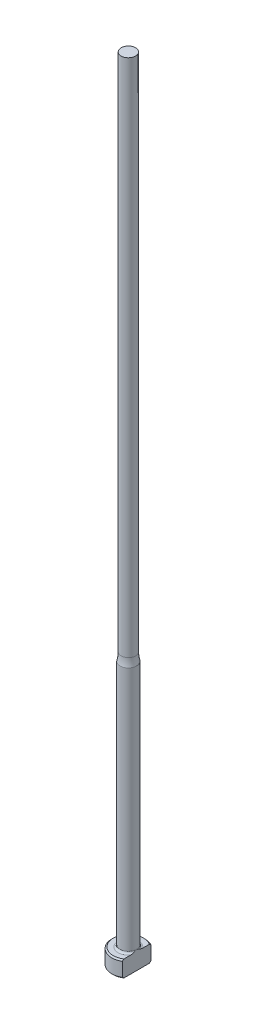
ISO-10303-21;
HEADER;
FILE_DESCRIPTION(('STEP AP214'),'2;1');
FILE_NAME('part.step','',(''),(''),'','','');
FILE_SCHEMA(('AUTOMOTIVE_DESIGN { 1 0 10303 214 1 1 1 1 }'));
ENDSEC;
DATA;
#1=APPLICATION_CONTEXT('core data for automotive mechanical design processes');
#2=APPLICATION_PROTOCOL_DEFINITION('international standard','automotive_design',2000,#1);
#3=PRODUCT_CONTEXT('',#1,'mechanical');
#4=PRODUCT('Part','Part','',(#3));
#5=PRODUCT_RELATED_PRODUCT_CATEGORY('part','',(#4));
#6=PRODUCT_DEFINITION_FORMATION('','',#4);
#7=PRODUCT_DEFINITION_CONTEXT('part definition',#1,'design');
#8=PRODUCT_DEFINITION('design','',#6,#7);
#9=PRODUCT_DEFINITION_SHAPE('','',#8);
#10=(LENGTH_UNIT() NAMED_UNIT(*) SI_UNIT(.MILLI.,.METRE.));
#11=(NAMED_UNIT(*) PLANE_ANGLE_UNIT() SI_UNIT($,.RADIAN.));
#12=(NAMED_UNIT(*) SI_UNIT($,.STERADIAN.) SOLID_ANGLE_UNIT());
#13=UNCERTAINTY_MEASURE_WITH_UNIT(LENGTH_MEASURE(1.E-05),#10,'distance_accuracy_value','');
#14=(GEOMETRIC_REPRESENTATION_CONTEXT(3) GLOBAL_UNCERTAINTY_ASSIGNED_CONTEXT((#13)) GLOBAL_UNIT_ASSIGNED_CONTEXT((#10,
#11,#12)) REPRESENTATION_CONTEXT('',''));
#15=CARTESIAN_POINT('',(0.,0.,0.));
#16=DIRECTION('',(0.,0.,1.));
#17=DIRECTION('',(1.,0.,0.));
#18=AXIS2_PLACEMENT_3D('',#15,#16,#17);
#19=CARTESIAN_POINT('',(-3.17499999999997,3.175,0.));
#20=DIRECTION('',(0.,1.,0.));
#21=DIRECTION('',(0.,0.,1.));
#22=AXIS2_PLACEMENT_3D('',#19,#20,#21);
#23=PLANE('',#22);
#24=CARTESIAN_POINT('',(0.,3.175,0.));
#25=DIRECTION('',(0.,1.,0.));
#26=DIRECTION('',(0.,0.,1.));
#27=AXIS2_PLACEMENT_3D('',#24,#25,#26);
#28=CIRCLE('',#27,2.92099999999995);
#29=CARTESIAN_POINT('',(1.58749999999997,3.175,-2.45195529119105));
#30=VERTEX_POINT('',#29);
#31=CARTESIAN_POINT('',(1.58749999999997,3.175,2.45195529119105));
#32=VERTEX_POINT('',#31);
#33=EDGE_CURVE('E105',#30,#32,#28,.T.);
#34=ORIENTED_EDGE('',*,*,#33,.T.);
#35=DIRECTION('',(0.,0.,1.));
#36=VECTOR('',#35,1.);
#37=CARTESIAN_POINT('',(1.58749999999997,3.17500000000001,2.74963065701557));
#38=LINE('',#37,#36);
#39=CARTESIAN_POINT('',(1.58749999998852,3.175,1.16397422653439));
#40=VERTEX_POINT('',#39);
#41=EDGE_CURVE('E126',#40,#32,#38,.T.);
#42=ORIENTED_EDGE('',*,*,#41,.F.);
#43=CARTESIAN_POINT('',(0.,3.175,0.));
#44=DIRECTION('',(0.,1.,0.));
#45=DIRECTION('',(0.,0.,1.));
#46=AXIS2_PLACEMENT_3D('',#43,#44,#45);
#47=CIRCLE('',#46,1.96849999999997);
#48=CARTESIAN_POINT('',(1.58749999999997,3.175,-1.16397422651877));
#49=VERTEX_POINT('',#48);
#50=EDGE_CURVE('E11',#40,#49,#47,.F.);
#51=ORIENTED_EDGE('',*,*,#50,.T.);
#52=EDGE_CURVE('E52',#30,#49,#38,.T.);
#53=ORIENTED_EDGE('',*,*,#52,.F.);
#54=EDGE_LOOP('',(#34,#42,#51,#53));
#55=FACE_BOUND('',#54,.T.);
#56=ADVANCED_FACE('F32',(#55),#23,.T.);
#57=CARTESIAN_POINT('',(0.,259.958771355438,0.));
#58=DIRECTION('',(0.,1.,0.));
#59=DIRECTION('',(0.,0.,1.));
#60=AXIS2_PLACEMENT_3D('',#57,#58,#59);
#61=CYLINDRICAL_SURFACE('',#60,3.17499999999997);
#62=CARTESIAN_POINT('',(0.,2.92100000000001,0.));
#63=DIRECTION('',(0.,1.,0.));
#64=DIRECTION('',(0.,0.,1.));
#65=AXIS2_PLACEMENT_3D('',#62,#63,#64);
#66=CIRCLE('',#65,3.17499999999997);
#67=CARTESIAN_POINT('',(1.58749999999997,2.92100000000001,2.74963065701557));
#68=VERTEX_POINT('',#67);
#69=CARTESIAN_POINT('',(1.58749999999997,2.92100000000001,-2.74963065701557));
#70=VERTEX_POINT('',#69);
#71=EDGE_CURVE('E98',#68,#70,#66,.F.);
#72=ORIENTED_EDGE('',*,*,#71,.T.);
#73=DIRECTION('',(0.,-1.,0.));
#74=VECTOR('',#73,1.);
#75=CARTESIAN_POINT('',(1.58749999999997,152.401,-2.74963065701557));
#76=LINE('',#75,#74);
#77=CARTESIAN_POINT('',(1.58749999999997,0.254000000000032,-2.74963065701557));
#78=VERTEX_POINT('',#77);
#79=EDGE_CURVE('E141',#70,#78,#76,.T.);
#80=ORIENTED_EDGE('',*,*,#79,.T.);
#81=CARTESIAN_POINT('',(0.,0.254000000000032,0.));
#82=DIRECTION('',(0.,-1.,0.));
#83=DIRECTION('',(0.,0.,-1.));
#84=AXIS2_PLACEMENT_3D('',#81,#82,#83);
#85=CIRCLE('',#84,3.17499999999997);
#86=CARTESIAN_POINT('',(1.58749999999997,0.254000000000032,2.74963065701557));
#87=VERTEX_POINT('',#86);
#88=EDGE_CURVE('E95',#78,#87,#85,.F.);
#89=ORIENTED_EDGE('',*,*,#88,.T.);
#90=DIRECTION('',(0.,-1.,0.));
#91=VECTOR('',#90,1.);
#92=CARTESIAN_POINT('',(1.58749999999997,152.401,2.74963065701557));
#93=LINE('',#92,#91);
#94=EDGE_CURVE('E88',#68,#87,#93,.T.);
#95=ORIENTED_EDGE('',*,*,#94,.F.);
#96=EDGE_LOOP('',(#72,#80,#89,#95));
#97=FACE_BOUND('',#96,.T.);
#98=ADVANCED_FACE('F191',(#97),#61,.T.);
#99=CARTESIAN_POINT('',(0.,0.,0.));
#100=DIRECTION('',(0.,-1.,0.));
#101=DIRECTION('',(0.,0.,-1.));
#102=AXIS2_PLACEMENT_3D('',#99,#100,#101);
#103=PLANE('',#102);
#104=CARTESIAN_POINT('',(0.,0.,0.));
#105=DIRECTION('',(0.,-1.,0.));
#106=DIRECTION('',(0.,0.,-1.));
#107=AXIS2_PLACEMENT_3D('',#104,#105,#106);
#108=CIRCLE('',#107,2.92099999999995);
#109=CARTESIAN_POINT('',(1.58749999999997,0.,2.45195529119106));
#110=VERTEX_POINT('',#109);
#111=CARTESIAN_POINT('',(1.58749999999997,0.,-2.45195529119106));
#112=VERTEX_POINT('',#111);
#113=EDGE_CURVE('E93',#110,#112,#108,.T.);
#114=ORIENTED_EDGE('',*,*,#113,.T.);
#115=DIRECTION('',(0.,0.,1.));
#116=VECTOR('',#115,1.);
#117=CARTESIAN_POINT('',(1.58749999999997,0.,2.74963065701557));
#118=LINE('',#117,#116);
#119=EDGE_CURVE('E78',#112,#110,#118,.T.);
#120=ORIENTED_EDGE('',*,*,#119,.T.);
#121=EDGE_LOOP('',(#114,#120));
#122=FACE_BOUND('',#121,.T.);
#123=ADVANCED_FACE('F97',(#122),#103,.T.);
#124=CARTESIAN_POINT('',(0.,3.17499999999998,0.));
#125=DIRECTION('',(0.,-1.,0.));
#126=DIRECTION('',(0.,0.,-1.));
#127=AXIS2_PLACEMENT_3D('',#124,#125,#126);
#128=CONICAL_SURFACE('',#127,2.92099999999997,0.7853981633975);
#129=ORIENTED_EDGE('',*,*,#71,.F.);
#130=CARTESIAN_POINT('',(1.58749999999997,-0.161620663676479,-6.0529050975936));
#131=CARTESIAN_POINT('',(1.58749999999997,-0.0288893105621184,-5.91567682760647));
#132=CARTESIAN_POINT('',(1.58749999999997,0.103699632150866,-5.77831035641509));
#133=CARTESIAN_POINT('',(1.58749999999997,0.36850839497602,-5.5032187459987));
#134=CARTESIAN_POINT('',(1.58749999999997,0.500728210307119,-5.36549360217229));
#135=CARTESIAN_POINT('',(1.58749999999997,0.764778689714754,-5.08953516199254));
#136=CARTESIAN_POINT('',(1.58749999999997,0.896609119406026,-4.95130164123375));
#137=CARTESIAN_POINT('',(1.58749999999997,1.15968706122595,-4.67428233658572));
#138=CARTESIAN_POINT('',(1.58749999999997,1.29093457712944,-4.53549655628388));
#139=CARTESIAN_POINT('',(1.58749999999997,1.55007705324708,-4.25997724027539));
#140=CARTESIAN_POINT('',(1.58749999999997,1.67798684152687,-4.12325766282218));
#141=CARTESIAN_POINT('',(1.58749999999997,1.93284861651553,-3.84892898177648));
#142=CARTESIAN_POINT('',(1.58749999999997,2.05980060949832,-3.71131988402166));
#143=CARTESIAN_POINT('',(1.58749999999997,2.31237508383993,-3.43493978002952));
#144=CARTESIAN_POINT('',(1.58749999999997,2.43799784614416,-3.29616903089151));
#145=CARTESIAN_POINT('',(1.58749999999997,2.68741369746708,-3.01699558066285));
#146=CARTESIAN_POINT('',(1.58749999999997,2.81120686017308,-2.87659294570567));
#147=CARTESIAN_POINT('',(1.58749999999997,3.0087586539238,-2.6481670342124));
#148=CARTESIAN_POINT('',(1.58749999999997,3.08336151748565,-2.56087478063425));
#149=CARTESIAN_POINT('',(1.58749999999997,3.23123871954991,-2.38515423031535));
#150=CARTESIAN_POINT('',(1.58749999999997,3.30451292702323,-2.29672582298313));
#151=CARTESIAN_POINT('',(1.58749999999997,3.45004422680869,-2.1174740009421));
#152=CARTESIAN_POINT('',(1.58749999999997,3.52228237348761,-2.02663514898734));
#153=CARTESIAN_POINT('',(1.58749999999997,3.6642309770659,-1.8430252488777));
#154=CARTESIAN_POINT('',(1.58749999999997,3.73394203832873,-1.75025467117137));
#155=CARTESIAN_POINT('',(1.58749999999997,3.87080633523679,-1.56067475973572));
#156=CARTESIAN_POINT('',(1.58749999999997,3.93790459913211,-1.46382547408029));
#157=CARTESIAN_POINT('',(1.58749999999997,4.06669147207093,-1.26632594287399));
#158=CARTESIAN_POINT('',(1.58749999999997,4.12837264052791,-1.16567073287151));
#159=CARTESIAN_POINT('',(1.58749999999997,4.2140225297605,-1.01165766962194));
#160=CARTESIAN_POINT('',(1.58749999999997,4.24127929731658,-0.960142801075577));
#161=CARTESIAN_POINT('',(1.58749999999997,4.29309798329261,-0.855780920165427));
#162=CARTESIAN_POINT('',(1.58749999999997,4.31765941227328,-0.802933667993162));
#163=CARTESIAN_POINT('',(1.58749999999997,4.38614656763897,-0.64246114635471));
#164=CARTESIAN_POINT('',(1.58749999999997,4.42510149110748,-0.532518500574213));
#165=CARTESIAN_POINT('',(1.58749999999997,4.46726244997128,-0.367680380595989));
#166=CARTESIAN_POINT('',(1.58749999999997,4.47844427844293,-0.314802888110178));
#167=CARTESIAN_POINT('',(1.58749999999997,4.495766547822,-0.2082097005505));
#168=CARTESIAN_POINT('',(1.58749999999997,4.50190743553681,-0.154494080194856));
#169=CARTESIAN_POINT('',(1.58749999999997,4.50871296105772,-0.0468792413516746));
#170=CARTESIAN_POINT('',(1.58749999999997,4.50939451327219,0.0070188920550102));
#171=CARTESIAN_POINT('',(1.58749999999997,4.50527679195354,0.114606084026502));
#172=CARTESIAN_POINT('',(1.58749999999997,4.50047706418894,0.168295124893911));
#173=CARTESIAN_POINT('',(1.58749999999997,4.48579689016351,0.274485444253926));
#174=CARTESIAN_POINT('',(1.58749999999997,4.47596081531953,0.326992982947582));
#175=CARTESIAN_POINT('',(1.58749999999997,4.45181809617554,0.430974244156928));
#176=CARTESIAN_POINT('',(1.58749999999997,4.43750969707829,0.48244755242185));
#177=CARTESIAN_POINT('',(1.58749999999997,4.40502489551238,0.584460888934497));
#178=CARTESIAN_POINT('',(1.58749999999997,4.38682724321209,0.634994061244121));
#179=CARTESIAN_POINT('',(1.58749999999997,4.34729308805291,0.734789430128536));
#180=CARTESIAN_POINT('',(1.58749999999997,4.32595722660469,0.784051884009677));
#181=CARTESIAN_POINT('',(1.58749999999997,4.25791922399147,0.930549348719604));
#182=CARTESIAN_POINT('',(1.58749999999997,4.20736047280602,1.02598802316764));
#183=CARTESIAN_POINT('',(1.58749999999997,4.09955451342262,1.2130431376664));
#184=CARTESIAN_POINT('',(1.58749999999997,4.04229912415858,1.30465471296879));
#185=CARTESIAN_POINT('',(1.58749999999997,3.9230874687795,1.4852621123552));
#186=CARTESIAN_POINT('',(1.58749999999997,3.86111349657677,1.57424615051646));
#187=CARTESIAN_POINT('',(1.58749999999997,3.73408621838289,1.74990003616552));
#188=CARTESIAN_POINT('',(1.58749999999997,3.66903444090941,1.8365709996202));
#189=CARTESIAN_POINT('',(1.58749999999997,3.53583371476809,2.00931764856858));
#190=CARTESIAN_POINT('',(1.58749999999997,3.46765527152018,2.09537048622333));
#191=CARTESIAN_POINT('',(1.58749999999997,3.32960643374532,2.26611736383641));
#192=CARTESIAN_POINT('',(1.58749999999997,3.25973586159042,2.35081125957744));
#193=CARTESIAN_POINT('',(1.58749999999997,3.04858139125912,2.60290121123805));
#194=CARTESIAN_POINT('',(1.58749999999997,2.90542388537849,2.76872537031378));
#195=CARTESIAN_POINT('',(1.58749999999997,2.64069522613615,3.06970913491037));
#196=CARTESIAN_POINT('',(1.58749999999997,2.5195945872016,3.20528660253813));
#197=CARTESIAN_POINT('',(1.58749999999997,2.275904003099,3.47510321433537));
#198=CARTESIAN_POINT('',(1.58749999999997,2.15331401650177,3.60934232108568));
#199=CARTESIAN_POINT('',(1.58749999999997,1.90694239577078,3.87695374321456));
#200=CARTESIAN_POINT('',(1.58749999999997,1.78315974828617,4.01032512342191));
#201=CARTESIAN_POINT('',(1.58749999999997,1.53478104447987,4.2763088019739));
#202=CARTESIAN_POINT('',(1.58749999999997,1.41018498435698,4.40892109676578));
#203=CARTESIAN_POINT('',(1.58749999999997,1.0457468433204,4.79499418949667));
#204=CARTESIAN_POINT('',(1.58749999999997,0.805076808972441,5.04767313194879));
#205=CARTESIAN_POINT('',(1.58749999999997,0.443121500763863,5.42550911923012));
#206=CARTESIAN_POINT('',(1.58749999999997,0.322378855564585,5.55118772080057));
#207=CARTESIAN_POINT('',(1.58749999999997,0.0805914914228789,5.80225207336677));
#208=CARTESIAN_POINT('',(1.58749999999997,-0.0404532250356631,5.92763782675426));
#209=CARTESIAN_POINT('',(1.58749999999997,-0.161620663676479,6.0529050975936));
#210=B_SPLINE_CURVE_WITH_KNOTS('',3,(#130,#131,#132,#133,#134,#135,#136,#137,#138,#139,#140,
#141,#142,#143,#144,#145,#146,#147,#148,#149,#150,#151,#152,#153,#154,#155,#156,#157,#158,#159,
#160,#161,#162,#163,#164,#165,#166,#167,#168,#169,#170,#171,#172,#173,#174,#175,#176,#177,#178,
#179,#180,#181,#182,#183,#184,#185,#186,#187,#188,#189,#190,#191,#192,#193,#194,#195,#196,#197,
#198,#199,#200,#201,#202,#203,#204,#205,#206,#207,#208,#209),.UNSPECIFIED.,.F.,.F.,(4,2,2,2,2,2,
2,2,2,2,2,2,2,2,2,2,2,2,2,2,2,2,2,2,2,2,2,2,2,2,2,2,2,2,2,2,2,2,2,4),(0.,0.572750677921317,
1.14550874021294,1.71856057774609,2.29160869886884,2.85328006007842,3.41494773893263,
3.97649423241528,4.53801804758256,4.88249307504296,5.22700189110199,5.57515326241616,
5.92322081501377,6.27657800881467,6.63041319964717,6.80518126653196,6.97998101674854,
7.32824262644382,7.49018491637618,7.65211285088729,7.813538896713,7.97497832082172,
8.13501929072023,8.29512313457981,8.4561251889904,8.61709438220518,8.94062993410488,
9.26456495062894,9.58978187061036,9.91483894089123,10.2441741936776,10.5735441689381,
11.2306812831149,11.7760337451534,12.3214014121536,12.8672825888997,13.4131663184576,
14.4600164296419,14.9828595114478,15.505698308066),.UNSPECIFIED.);
#211=EDGE_CURVE('E118',#32,#68,#210,.T.);
#212=ORIENTED_EDGE('',*,*,#211,.F.);
#213=ORIENTED_EDGE('',*,*,#33,.F.);
#214=EDGE_CURVE('E117',#70,#30,#210,.T.);
#215=ORIENTED_EDGE('',*,*,#214,.F.);
#216=EDGE_LOOP('',(#129,#212,#213,#215));
#217=FACE_BOUND('',#216,.T.);
#218=ADVANCED_FACE('F162',(#217),#128,.T.);
#219=CARTESIAN_POINT('',(0.,0.254000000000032,0.));
#220=DIRECTION('',(0.,1.,0.));
#221=DIRECTION('',(0.,0.,1.));
#222=AXIS2_PLACEMENT_3D('',#219,#220,#221);
#223=CONICAL_SURFACE('',#222,3.17499999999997,0.785398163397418);
#224=ORIENTED_EDGE('',*,*,#88,.F.);
#225=CARTESIAN_POINT('',(1.58749999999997,3.33662066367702,6.0529050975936));
#226=CARTESIAN_POINT('',(1.58749999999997,3.20388931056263,5.91567682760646));
#227=CARTESIAN_POINT('',(1.58749999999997,3.0713003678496,5.77831035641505));
#228=CARTESIAN_POINT('',(1.58749999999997,2.80649160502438,5.50321874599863));
#229=CARTESIAN_POINT('',(1.58749999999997,2.67427178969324,5.36549360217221));
#230=CARTESIAN_POINT('',(1.58749999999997,2.41022131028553,5.08953516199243));
#231=CARTESIAN_POINT('',(1.58749999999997,2.27839088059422,4.95130164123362));
#232=CARTESIAN_POINT('',(1.58749999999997,2.01531293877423,4.67428233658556));
#233=CARTESIAN_POINT('',(1.58749999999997,1.8840654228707,4.5354965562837));
#234=CARTESIAN_POINT('',(1.58749999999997,1.62492294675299,4.25997724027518));
#235=CARTESIAN_POINT('',(1.58749999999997,1.49701315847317,4.12325766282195));
#236=CARTESIAN_POINT('',(1.58749999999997,1.24215138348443,3.84892898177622));
#237=CARTESIAN_POINT('',(1.58749999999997,1.11519939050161,3.71131988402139));
#238=CARTESIAN_POINT('',(1.58749999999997,0.862624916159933,3.43493978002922));
#239=CARTESIAN_POINT('',(1.58749999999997,0.737002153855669,3.29616903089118));
#240=CARTESIAN_POINT('',(1.58749999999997,0.487586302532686,3.01699558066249));
#241=CARTESIAN_POINT('',(1.58749999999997,0.363793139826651,2.8765929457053));
#242=CARTESIAN_POINT('',(1.58749999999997,0.1662413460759,2.64816703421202));
#243=CARTESIAN_POINT('',(1.58749999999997,0.0916384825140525,2.56087478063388));
#244=CARTESIAN_POINT('',(1.58749999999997,-0.0562387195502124,2.385154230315));
#245=CARTESIAN_POINT('',(1.58749999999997,-0.129512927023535,2.29672582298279));
#246=CARTESIAN_POINT('',(1.58749999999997,-0.275044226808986,2.11747400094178));
#247=CARTESIAN_POINT('',(1.58749999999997,-0.34728237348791,2.02663514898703));
#248=CARTESIAN_POINT('',(1.58749999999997,-0.489230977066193,1.84302524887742));
#249=CARTESIAN_POINT('',(1.58749999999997,-0.558942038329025,1.75025467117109));
#250=CARTESIAN_POINT('',(1.58749999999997,-0.695806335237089,1.56067475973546));
#251=CARTESIAN_POINT('',(1.58749999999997,-0.762904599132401,1.46382547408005));
#252=CARTESIAN_POINT('',(1.58749999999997,-0.89169147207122,1.26632594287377));
#253=CARTESIAN_POINT('',(1.58749999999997,-0.953372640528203,1.16567073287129));
#254=CARTESIAN_POINT('',(1.58749999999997,-1.03902252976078,1.01165766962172));
#255=CARTESIAN_POINT('',(1.58749999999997,-1.06627929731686,0.960142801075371));
#256=CARTESIAN_POINT('',(1.58749999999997,-1.11809798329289,0.855780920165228));
#257=CARTESIAN_POINT('',(1.58749999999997,-1.14265941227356,0.802933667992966));
#258=CARTESIAN_POINT('',(1.58749999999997,-1.21114656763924,0.642461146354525));
#259=CARTESIAN_POINT('',(1.58749999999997,-1.25010149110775,0.532518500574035));
#260=CARTESIAN_POINT('',(1.58749999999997,-1.29226244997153,0.36768038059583));
#261=CARTESIAN_POINT('',(1.58749999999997,-1.30344427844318,0.31480288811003));
#262=CARTESIAN_POINT('',(1.58749999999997,-1.32076654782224,0.208209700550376));
#263=CARTESIAN_POINT('',(1.58749999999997,-1.32690743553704,0.154494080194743));
#264=CARTESIAN_POINT('',(1.58749999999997,-1.33371296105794,0.0468792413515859));
#265=CARTESIAN_POINT('',(1.58749999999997,-1.33439451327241,-0.0070188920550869));
#266=CARTESIAN_POINT('',(1.58749999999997,-1.33027679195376,-0.114606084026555));
#267=CARTESIAN_POINT('',(1.58749999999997,-1.32547706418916,-0.168295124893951));
#268=CARTESIAN_POINT('',(1.58749999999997,-1.31079689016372,-0.274485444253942));
#269=CARTESIAN_POINT('',(1.58749999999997,-1.30096081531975,-0.326992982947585));
#270=CARTESIAN_POINT('',(1.58749999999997,-1.27681809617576,-0.430974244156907));
#271=CARTESIAN_POINT('',(1.58749999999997,-1.26250969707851,-0.482447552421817));
#272=CARTESIAN_POINT('',(1.58749999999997,-1.2300248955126,-0.584460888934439));
#273=CARTESIAN_POINT('',(1.58749999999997,-1.21182724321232,-0.634994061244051));
#274=CARTESIAN_POINT('',(1.58749999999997,-1.17229308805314,-0.734789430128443));
#275=CARTESIAN_POINT('',(1.58749999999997,-1.15095722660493,-0.784051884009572));
#276=CARTESIAN_POINT('',(1.58749999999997,-1.08291922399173,-0.93054934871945));
#277=CARTESIAN_POINT('',(1.58749999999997,-1.0323604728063,-1.02598802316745));
#278=CARTESIAN_POINT('',(1.58749999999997,-0.92455451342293,-1.21304313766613));
#279=CARTESIAN_POINT('',(1.58749999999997,-0.867299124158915,-1.30465471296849));
#280=CARTESIAN_POINT('',(1.58749999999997,-0.748087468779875,-1.48526211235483));
#281=CARTESIAN_POINT('',(1.58749999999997,-0.686113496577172,-1.57424615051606));
#282=CARTESIAN_POINT('',(1.58749999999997,-0.559086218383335,-1.74990003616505));
#283=CARTESIAN_POINT('',(1.58749999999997,-0.494034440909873,-1.83657099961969));
#284=CARTESIAN_POINT('',(1.58749999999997,-0.360833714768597,-2.00931764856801));
#285=CARTESIAN_POINT('',(1.58749999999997,-0.292655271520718,-2.09537048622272));
#286=CARTESIAN_POINT('',(1.58749999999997,-0.154606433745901,-2.26611736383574));
#287=CARTESIAN_POINT('',(1.58749999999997,-0.084735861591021,-2.35081125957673));
#288=CARTESIAN_POINT('',(1.58749999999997,0.126418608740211,-2.60290121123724));
#289=CARTESIAN_POINT('',(1.58749999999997,0.26957611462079,-2.76872537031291));
#290=CARTESIAN_POINT('',(1.58749999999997,0.534304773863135,-3.06970913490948));
#291=CARTESIAN_POINT('',(1.58749999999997,0.655405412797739,-3.20528660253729));
#292=CARTESIAN_POINT('',(1.58749999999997,0.899095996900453,-3.47510321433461));
#293=CARTESIAN_POINT('',(1.58749999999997,1.02168598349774,-3.60934232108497));
#294=CARTESIAN_POINT('',(1.58749999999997,1.26805760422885,-3.87695374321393));
#295=CARTESIAN_POINT('',(1.58749999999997,1.39184025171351,-4.01032512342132));
#296=CARTESIAN_POINT('',(1.58749999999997,1.64021895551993,-4.2763088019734));
#297=CARTESIAN_POINT('',(1.58749999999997,1.76481501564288,-4.40892109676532));
#298=CARTESIAN_POINT('',(1.58749999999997,2.12925315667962,-4.79499418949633));
#299=CARTESIAN_POINT('',(1.58749999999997,2.36992319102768,-5.04767313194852));
#300=CARTESIAN_POINT('',(1.58749999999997,2.73187849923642,-5.42550911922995));
#301=CARTESIAN_POINT('',(1.58749999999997,2.85262114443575,-5.55118772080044));
#302=CARTESIAN_POINT('',(1.58749999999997,3.09440850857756,-5.8022520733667));
#303=CARTESIAN_POINT('',(1.58749999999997,3.21545322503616,-5.92763782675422));
#304=CARTESIAN_POINT('',(1.58749999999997,3.33662066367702,-6.0529050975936));
#305=B_SPLINE_CURVE_WITH_KNOTS('',3,(#225,#226,#227,#228,#229,#230,#231,#232,#233,#234,#235,
#236,#237,#238,#239,#240,#241,#242,#243,#244,#245,#246,#247,#248,#249,#250,#251,#252,#253,#254,
#255,#256,#257,#258,#259,#260,#261,#262,#263,#264,#265,#266,#267,#268,#269,#270,#271,#272,#273,
#274,#275,#276,#277,#278,#279,#280,#281,#282,#283,#284,#285,#286,#287,#288,#289,#290,#291,#292,
#293,#294,#295,#296,#297,#298,#299,#300,#301,#302,#303,#304),.UNSPECIFIED.,.F.,.F.,(4,2,2,2,2,2,
2,2,2,2,2,2,2,2,2,2,2,2,2,2,2,2,2,2,2,2,2,2,2,2,2,2,2,2,2,2,2,2,2,4),(0.,0.572750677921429,
1.14550874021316,1.71856057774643,2.29160869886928,2.85328006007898,3.41494773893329,
3.97649423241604,4.53801804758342,4.8824930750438,5.22700189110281,5.57515326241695,
5.92322081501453,6.27657800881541,6.63041319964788,6.80518126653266,6.97998101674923,
7.32824262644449,7.49018491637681,7.65211285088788,7.81353889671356,7.97497832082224,
8.13501929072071,8.29512313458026,8.45612518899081,8.61709438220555,8.94062993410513,
9.26456495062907,9.58978187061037,9.91483894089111,10.2441741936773,10.5735441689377,
11.2306812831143,11.776033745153,12.3214014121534,12.8672825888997,13.4131663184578,
14.4600164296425,14.9828595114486,15.505698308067),.UNSPECIFIED.);
#306=EDGE_CURVE('E81',#112,#78,#305,.T.);
#307=ORIENTED_EDGE('',*,*,#306,.F.);
#308=ORIENTED_EDGE('',*,*,#113,.F.);
#309=EDGE_CURVE('E84',#87,#110,#305,.T.);
#310=ORIENTED_EDGE('',*,*,#309,.F.);
#311=EDGE_LOOP('',(#224,#307,#308,#310));
#312=FACE_BOUND('',#311,.T.);
#313=ADVANCED_FACE('F92',(#312),#223,.T.);
#314=CARTESIAN_POINT('',(0.,3.556,0.));
#315=DIRECTION('',(0.,1.,0.));
#316=DIRECTION('',(0.,0.,1.));
#317=AXIS2_PLACEMENT_3D('',#314,#315,#316);
#318=TOROIDAL_SURFACE('',#317,1.96849999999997,0.381);
#319=CARTESIAN_POINT('',(1.58749999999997,3.556,0.));
#320=CARTESIAN_POINT('',(1.58749999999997,3.55599928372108,-9.72839998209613E-12));
#321=CARTESIAN_POINT('',(1.58749999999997,3.55599856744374,-1.16390048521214E-07));
#322=CARTESIAN_POINT('',(1.58749999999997,3.55599717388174,-5.02802253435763E-07));
#323=CARTESIAN_POINT('',(1.58749999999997,3.55599649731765,-7.75049116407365E-07));
#324=CARTESIAN_POINT('',(1.58749999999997,3.55599515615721,-1.43578185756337E-06));
#325=CARTESIAN_POINT('',(1.58749999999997,3.55599449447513,-1.83004116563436E-06));
#326=CARTESIAN_POINT('',(1.58749999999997,3.55599322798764,-2.69326525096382E-06));
#327=CARTESIAN_POINT('',(1.58749999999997,3.55599262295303,-3.16190628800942E-06));
#328=CARTESIAN_POINT('',(1.58749999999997,3.55599066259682,-4.80183833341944E-06));
#329=CARTESIAN_POINT('',(1.58749999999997,3.55598938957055,-6.07237548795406E-06));
#330=CARTESIAN_POINT('',(1.58749999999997,3.55598706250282,-8.74131694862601E-06));
#331=CARTESIAN_POINT('',(1.58749999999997,3.55598600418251,-1.01362054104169E-05));
#332=CARTESIAN_POINT('',(1.58749999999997,3.55598220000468,-1.54025644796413E-05));
#333=CARTESIAN_POINT('',(1.58749999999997,3.55597966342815,-1.94297992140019E-05));
#334=CARTESIAN_POINT('',(1.58749999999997,3.55597535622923,-2.75116574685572E-05));
#335=CARTESIAN_POINT('',(1.58749999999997,3.55597354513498,-3.15456374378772E-05));
#336=CARTESIAN_POINT('',(1.58749999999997,3.55596616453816,-4.82039076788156E-05));
#337=CARTESIAN_POINT('',(1.58749999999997,3.55596077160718,-6.08993138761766E-05));
#338=CARTESIAN_POINT('',(1.58749999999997,3.55595181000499,-8.49758225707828E-05));
#339=CARTESIAN_POINT('',(1.58749999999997,3.55594809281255,-9.6299831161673E-05));
#340=CARTESIAN_POINT('',(1.58749999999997,3.55591954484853,-0.000176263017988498));
#341=CARTESIAN_POINT('',(1.58749999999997,3.55588430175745,-0.000240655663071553));
#342=CARTESIAN_POINT('',(1.58749999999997,3.55575419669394,-0.000487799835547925));
#343=CARTESIAN_POINT('',(1.58749999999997,3.55566706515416,-0.000673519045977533));
#344=CARTESIAN_POINT('',(1.58749999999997,3.55532896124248,-0.00138308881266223));
#345=CARTESIAN_POINT('',(1.58749999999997,3.55506990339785,-0.0019038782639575));
#346=CARTESIAN_POINT('',(1.58749999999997,3.55403272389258,-0.00399959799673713));
#347=CARTESIAN_POINT('',(1.58749999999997,3.55326363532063,-0.0055779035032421));
#348=CARTESIAN_POINT('',(1.58749999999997,3.53734419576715,-0.0382341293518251));
#349=CARTESIAN_POINT('',(1.58749999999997,3.52209124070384,-0.0692744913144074));
#350=CARTESIAN_POINT('',(1.58749999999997,3.49234031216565,-0.130397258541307));
#351=CARTESIAN_POINT('',(1.58749999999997,3.4778343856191,-0.160476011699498));
#352=CARTESIAN_POINT('',(1.58749999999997,3.44756579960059,-0.22405302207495));
#353=CARTESIAN_POINT('',(1.58749999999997,3.43183768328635,-0.257567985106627));
#354=CARTESIAN_POINT('',(1.58749999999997,3.40084315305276,-0.325196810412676));
#355=CARTESIAN_POINT('',(1.58749999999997,3.38558252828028,-0.359313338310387));
#356=CARTESIAN_POINT('',(1.58749999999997,3.35947844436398,-0.419670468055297));
#357=CARTESIAN_POINT('',(1.58749999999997,3.34845502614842,-0.445832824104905));
#358=CARTESIAN_POINT('',(1.58749999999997,3.32703860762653,-0.498343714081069));
#359=CARTESIAN_POINT('',(1.58749999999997,3.31664422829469,-0.52469168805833));
#360=CARTESIAN_POINT('',(1.58749999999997,3.2869407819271,-0.603098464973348));
#361=CARTESIAN_POINT('',(1.58749999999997,3.26865317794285,-0.655557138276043));
#362=CARTESIAN_POINT('',(1.58749999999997,3.24332469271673,-0.737608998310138));
#363=CARTESIAN_POINT('',(1.58749999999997,3.23494346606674,-0.766787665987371));
#364=CARTESIAN_POINT('',(1.58749999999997,3.21949479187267,-0.825628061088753));
#365=CARTESIAN_POINT('',(1.58749999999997,3.21243348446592,-0.855291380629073));
#366=CARTESIAN_POINT('',(1.58749999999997,3.19303275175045,-0.947623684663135));
#367=CARTESIAN_POINT('',(1.58749999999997,3.18336484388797,-1.01091582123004));
#368=CARTESIAN_POINT('',(1.58749999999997,3.17464826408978,-1.12491727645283));
#369=CARTESIAN_POINT('',(1.58749999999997,3.17379742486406,-1.17548103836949));
#370=CARTESIAN_POINT('',(1.58749999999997,3.17980825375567,-1.2756075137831));
#371=CARTESIAN_POINT('',(1.58749999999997,3.18656467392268,-1.32517446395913));
#372=CARTESIAN_POINT('',(1.58749999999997,3.20510062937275,-1.40268723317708));
#373=CARTESIAN_POINT('',(1.58749999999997,3.21379930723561,-1.43136704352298));
#374=CARTESIAN_POINT('',(1.58749999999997,3.23523847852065,-1.48727388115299));
#375=CARTESIAN_POINT('',(1.58749999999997,3.24798385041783,-1.51449910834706));
#376=CARTESIAN_POINT('',(1.58749999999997,3.27479889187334,-1.56082978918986));
#377=CARTESIAN_POINT('',(1.58749999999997,3.2880084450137,-1.5804296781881));
#378=CARTESIAN_POINT('',(1.58749999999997,3.31738741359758,-1.61726850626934));
#379=CARTESIAN_POINT('',(1.58749999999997,3.33355126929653,-1.63451177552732));
#380=CARTESIAN_POINT('',(1.58749999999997,3.3650209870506,-1.66235366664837));
#381=CARTESIAN_POINT('',(1.58749999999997,3.37976591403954,-1.67358404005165));
#382=CARTESIAN_POINT('',(1.58749999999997,3.41090649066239,-1.69348690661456));
#383=CARTESIAN_POINT('',(1.58749999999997,3.42730148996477,-1.70216040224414));
#384=CARTESIAN_POINT('',(1.58749999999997,3.46152587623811,-1.71647536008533));
#385=CARTESIAN_POINT('',(1.58749999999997,3.47936500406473,-1.72209384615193));
#386=CARTESIAN_POINT('',(1.58749999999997,3.51579449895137,-1.72977101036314));
#387=CARTESIAN_POINT('',(1.58749999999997,3.53438431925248,-1.73183223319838));
#388=CARTESIAN_POINT('',(1.58749999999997,3.5693049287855,-1.73220894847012));
#389=CARTESIAN_POINT('',(1.58749999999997,3.58563247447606,-1.73095378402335));
#390=CARTESIAN_POINT('',(1.58749999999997,3.61782719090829,-1.72566824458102));
#391=CARTESIAN_POINT('',(1.58749999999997,3.6336944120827,-1.72163817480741));
#392=CARTESIAN_POINT('',(1.58749999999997,3.66430913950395,-1.71112762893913));
#393=CARTESIAN_POINT('',(1.58749999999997,3.67907021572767,-1.70468621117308));
#394=CARTESIAN_POINT('',(1.58749999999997,3.7074589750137,-1.68967506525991));
#395=CARTESIAN_POINT('',(1.58749999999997,3.72108625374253,-1.68110458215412));
#396=CARTESIAN_POINT('',(1.58749999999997,3.75190835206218,-1.6586320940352));
#397=CARTESIAN_POINT('',(1.58749999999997,3.76852524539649,-1.64393589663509));
#398=CARTESIAN_POINT('',(1.58749999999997,3.79915076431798,-1.61203006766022));
#399=CARTESIAN_POINT('',(1.58749999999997,3.81315342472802,-1.59481484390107));
#400=CARTESIAN_POINT('',(1.58749999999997,3.84335302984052,-1.55180967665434));
#401=CARTESIAN_POINT('',(1.58749999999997,3.85840997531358,-1.52522183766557));
#402=CARTESIAN_POINT('',(1.58749999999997,3.8840928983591,-1.47008223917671));
#403=CARTESIAN_POINT('',(1.58749999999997,3.89472145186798,-1.44153163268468));
#404=CARTESIAN_POINT('',(1.58749999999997,3.91656912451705,-1.36850699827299));
#405=CARTESIAN_POINT('',(1.58749999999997,3.92534811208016,-1.32330828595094));
#406=CARTESIAN_POINT('',(1.58749999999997,3.93598980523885,-1.23163561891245));
#407=CARTESIAN_POINT('',(1.58749999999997,3.93776012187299,-1.18515271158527));
#408=CARTESIAN_POINT('',(1.58749999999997,3.93485724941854,-1.056626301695));
#409=CARTESIAN_POINT('',(1.58749999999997,3.9241811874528,-0.974728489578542));
#410=CARTESIAN_POINT('',(1.58749999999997,3.899893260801,-0.855941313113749));
#411=CARTESIAN_POINT('',(1.58749999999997,3.89075037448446,-0.817952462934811));
#412=CARTESIAN_POINT('',(1.58749999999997,3.87034922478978,-0.742758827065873));
#413=CARTESIAN_POINT('',(1.58749999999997,3.85910312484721,-0.705550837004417));
#414=CARTESIAN_POINT('',(1.58749999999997,3.83067738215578,-0.618900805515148));
#415=CARTESIAN_POINT('',(1.58749999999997,3.81279292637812,-0.56969368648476));
#416=CARTESIAN_POINT('',(1.58749999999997,3.78404415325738,-0.496059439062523));
#417=CARTESIAN_POINT('',(1.58749999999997,3.77402894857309,-0.471293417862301));
#418=CARTESIAN_POINT('',(1.58749999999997,3.75347166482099,-0.421913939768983));
#419=CARTESIAN_POINT('',(1.58749999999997,3.74292842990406,-0.39730096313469));
#420=CARTESIAN_POINT('',(1.58749999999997,3.71797467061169,-0.340371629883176));
#421=CARTESIAN_POINT('',(1.58749999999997,3.7034106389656,-0.308122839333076));
#422=CARTESIAN_POINT('',(1.58749999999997,3.67389634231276,-0.244169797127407));
#423=CARTESIAN_POINT('',(1.58749999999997,3.65895097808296,-0.212463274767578));
#424=CARTESIAN_POINT('',(1.58749999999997,3.63022587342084,-0.152300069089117));
#425=CARTESIAN_POINT('',(1.58749999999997,3.61647532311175,-0.123829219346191));
#426=CARTESIAN_POINT('',(1.58749999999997,3.58829058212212,-0.065967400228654));
#427=CARTESIAN_POINT('',(1.58749999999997,3.57384944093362,-0.036579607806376));
#428=CARTESIAN_POINT('',(1.58749999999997,3.55873641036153,-0.00557801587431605));
#429=CARTESIAN_POINT('',(1.58749999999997,3.557967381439,-0.00399981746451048));
#430=CARTESIAN_POINT('',(1.58749999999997,3.55693021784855,-0.00190412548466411));
#431=CARTESIAN_POINT('',(1.58749999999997,3.55667111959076,-0.00138325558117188));
#432=CARTESIAN_POINT('',(1.58749999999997,3.55633296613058,-0.00067358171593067));
#433=CARTESIAN_POINT('',(1.58749999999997,3.55624582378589,-0.000487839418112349));
#434=CARTESIAN_POINT('',(1.58749999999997,3.55611570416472,-0.000240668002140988));
#435=CARTESIAN_POINT('',(1.58749999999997,3.55608045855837,-0.000176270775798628));
#436=CARTESIAN_POINT('',(1.58749999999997,3.55605190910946,-9.63021903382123E-05));
#437=CARTESIAN_POINT('',(1.58749999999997,3.55604819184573,-8.49777827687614E-05));
#438=CARTESIAN_POINT('',(1.58749999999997,3.55603922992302,-6.09004217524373E-05));
#439=CARTESIAN_POINT('',(1.58749999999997,3.55603383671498,-4.82045726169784E-05));
#440=CARTESIAN_POINT('',(1.58749999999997,3.55602645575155,-3.15458034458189E-05));
#441=CARTESIAN_POINT('',(1.58749999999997,3.55602464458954,-2.75117552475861E-05));
#442=CARTESIAN_POINT('',(1.58749999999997,3.55602033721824,-1.94297725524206E-05));
#443=CARTESIAN_POINT('',(1.58749999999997,3.55601780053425,-1.54024835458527E-05));
#444=CARTESIAN_POINT('',(1.58749999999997,3.55601399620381,-1.01360754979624E-05));
#445=CARTESIAN_POINT('',(1.58749999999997,3.55601293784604,-8.7411813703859E-06));
#446=CARTESIAN_POINT('',(1.58749999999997,3.55601061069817,-6.07223627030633E-06));
#447=CARTESIAN_POINT('',(1.58749999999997,3.55600933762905,-4.80170138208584E-06));
#448=CARTESIAN_POINT('',(1.58749999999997,3.55600737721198,-3.16178168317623E-06));
#449=CARTESIAN_POINT('',(1.58749999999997,3.55600677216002,-2.69314602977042E-06));
#450=CARTESIAN_POINT('',(1.58749999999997,3.55600550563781,-1.82993577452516E-06));
#451=CARTESIAN_POINT('',(1.58749999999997,3.55600484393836,-1.43568493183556E-06));
#452=CARTESIAN_POINT('',(1.58749999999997,3.55600350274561,-7.74972790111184E-07));
#453=CARTESIAN_POINT('',(1.58749999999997,3.55600282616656,-5.02737772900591E-07));
#454=CARTESIAN_POINT('',(1.58749999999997,3.55600143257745,-1.16354060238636E-07));
#455=CARTESIAN_POINT('',(1.58749999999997,3.55600071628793,9.72852226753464E-12));
#456=CARTESIAN_POINT('',(1.58749999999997,3.556,0.));
#457=B_SPLINE_CURVE_WITH_KNOTS('',3,(#319,#320,#321,#322,#323,#324,#325,#326,#327,#328,#329,
#330,#331,#332,#333,#334,#335,#336,#337,#338,#339,#340,#341,#342,#343,#344,#345,#346,#347,#348,
#349,#350,#351,#352,#353,#354,#355,#356,#357,#358,#359,#360,#361,#362,#363,#364,#365,#366,#367,
#368,#369,#370,#371,#372,#373,#374,#375,#376,#377,#378,#379,#380,#381,#382,#383,#384,#385,#386,
#387,#388,#389,#390,#391,#392,#393,#394,#395,#396,#397,#398,#399,#400,#401,#402,#403,#404,#405,
#406,#407,#408,#409,#410,#411,#412,#413,#414,#415,#416,#417,#418,#419,#420,#421,#422,#423,#424,
#425,#426,#427,#428,#429,#430,#431,#432,#433,#434,#435,#436,#437,#438,#439,#440,#441,#442,#443,
#444,#445,#446,#447,#448,#449,#450,#451,#452,#453,#454,#455,#456),.UNSPECIFIED.,.T.,.F.,(4,2,2,
2,2,2,2,2,2,2,2,2,2,2,2,2,2,2,2,2,2,2,2,2,2,2,2,2,2,2,2,2,2,2,2,2,2,2,2,2,2,2,2,2,2,2,2,2,2,2,2,
2,2,2,2,2,2,2,2,2,2,2,2,2,2,2,2,2,4),(0.,2.14653634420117E-06,4.3243617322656E-06,
6.62715069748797E-06,8.92017875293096E-06,1.42892293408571E-05,1.95376032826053E-05,
3.37616071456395E-05,4.70144492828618E-05,8.83789092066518E-05,0.000124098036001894,
0.000343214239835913,0.000959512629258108,0.00270343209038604,0.00797166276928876,
0.11171345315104,0.21189766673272,0.322958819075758,0.435072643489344,0.520234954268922,
0.605203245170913,0.771741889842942,0.862787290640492,0.954246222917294,1.14571222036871,
1.29701464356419,1.44624921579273,1.53592478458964,1.62570887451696,1.69637166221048,
1.76690281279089,1.82229027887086,1.87765600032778,1.93343255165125,1.98916918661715,
2.03805361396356,2.08693266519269,2.13505202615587,2.18318847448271,2.24937187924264,
2.31570450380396,2.4068617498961,2.49796589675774,2.63532677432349,2.77449244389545,
3.02069049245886,3.13789423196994,3.25444001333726,3.41142684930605,3.491566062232,
3.57188909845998,3.67803747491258,3.78319074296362,3.87804579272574,3.97626481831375,
3.98153268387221,3.98327687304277,3.98389324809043,3.98411237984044,3.98414810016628,
3.98418946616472,3.98420271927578,3.98421694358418,3.98422219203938,3.9842275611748,
3.98422985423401,3.98423215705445,3.98423433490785,3.98423648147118),.UNSPECIFIED.);
#458=CARTESIAN_POINT('',(1.58749999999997,3.556,0.));
#459=VERTEX_POINT('',#458);
#460=EDGE_CURVE('E47',#459,#49,#457,.T.);
#461=ORIENTED_EDGE('',*,*,#460,.T.);
#462=ORIENTED_EDGE('',*,*,#50,.F.);
#463=CARTESIAN_POINT('',(1.58749999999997,3.556,0.));
#464=CARTESIAN_POINT('',(1.58749999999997,3.55600071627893,9.72842792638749E-12));
#465=CARTESIAN_POINT('',(1.58749999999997,3.55600143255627,1.16390048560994E-07));
#466=CARTESIAN_POINT('',(1.58749999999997,3.55600282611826,5.02802253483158E-07));
#467=CARTESIAN_POINT('',(1.58749999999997,3.55600350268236,7.7504911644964E-07));
#468=CARTESIAN_POINT('',(1.58749999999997,3.5560048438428,1.43578185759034E-06));
#469=CARTESIAN_POINT('',(1.58749999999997,3.55600550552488,1.83004116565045E-06));
#470=CARTESIAN_POINT('',(1.58749999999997,3.55600677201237,2.69326525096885E-06));
#471=CARTESIAN_POINT('',(1.58749999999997,3.55600737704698,3.16190628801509E-06));
#472=CARTESIAN_POINT('',(1.58749999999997,3.55600933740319,4.80183833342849E-06));
#473=CARTESIAN_POINT('',(1.58749999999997,3.55601061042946,6.07237548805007E-06));
#474=CARTESIAN_POINT('',(1.58749999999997,3.55601293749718,8.74131694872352E-06));
#475=CARTESIAN_POINT('',(1.58749999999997,3.55601399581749,1.01362054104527E-05));
#476=CARTESIAN_POINT('',(1.58749999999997,3.55601779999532,1.54025644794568E-05));
#477=CARTESIAN_POINT('',(1.58749999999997,3.55602033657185,1.94297992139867E-05));
#478=CARTESIAN_POINT('',(1.58749999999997,3.55602464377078,2.75116574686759E-05));
#479=CARTESIAN_POINT('',(1.58749999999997,3.55602645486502,3.15456374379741E-05));
#480=CARTESIAN_POINT('',(1.58749999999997,3.55603383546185,4.8203907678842E-05));
#481=CARTESIAN_POINT('',(1.58749999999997,3.55603922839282,6.0899313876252E-05));
#482=CARTESIAN_POINT('',(1.58749999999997,3.55604818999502,8.49758225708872E-05));
#483=CARTESIAN_POINT('',(1.58749999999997,3.55605190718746,9.62998311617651E-05));
#484=CARTESIAN_POINT('',(1.58749999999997,3.55608045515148,0.000176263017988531));
#485=CARTESIAN_POINT('',(1.58749999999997,3.55611569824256,0.000240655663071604));
#486=CARTESIAN_POINT('',(1.58749999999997,3.55624580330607,0.000487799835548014));
#487=CARTESIAN_POINT('',(1.58749999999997,3.55633293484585,0.000673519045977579));
#488=CARTESIAN_POINT('',(1.58749999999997,3.55667103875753,0.00138308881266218));
#489=CARTESIAN_POINT('',(1.58749999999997,3.55693009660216,0.00190387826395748));
#490=CARTESIAN_POINT('',(1.58749999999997,3.55796727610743,0.00399959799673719));
#491=CARTESIAN_POINT('',(1.58749999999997,3.55873636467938,0.00557790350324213));
#492=CARTESIAN_POINT('',(1.58749999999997,3.57465580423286,0.038234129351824));
#493=CARTESIAN_POINT('',(1.58749999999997,3.58990875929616,0.0692744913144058));
#494=CARTESIAN_POINT('',(1.58749999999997,3.61965968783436,0.130397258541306));
#495=CARTESIAN_POINT('',(1.58749999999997,3.63416561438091,0.160476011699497));
#496=CARTESIAN_POINT('',(1.58749999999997,3.66443420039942,0.22405302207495));
#497=CARTESIAN_POINT('',(1.58749999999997,3.68016231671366,0.257567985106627));
#498=CARTESIAN_POINT('',(1.58749999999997,3.71115684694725,0.325196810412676));
#499=CARTESIAN_POINT('',(1.58749999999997,3.72641747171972,0.359313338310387));
#500=CARTESIAN_POINT('',(1.58749999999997,3.75252155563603,0.419670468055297));
#501=CARTESIAN_POINT('',(1.58749999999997,3.76354497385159,0.445832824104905));
#502=CARTESIAN_POINT('',(1.58749999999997,3.78496139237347,0.498343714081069));
#503=CARTESIAN_POINT('',(1.58749999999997,3.79535577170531,0.524691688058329));
#504=CARTESIAN_POINT('',(1.58749999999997,3.82505921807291,0.603098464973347));
#505=CARTESIAN_POINT('',(1.58749999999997,3.84334682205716,0.655557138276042));
#506=CARTESIAN_POINT('',(1.58749999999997,3.86867530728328,0.737608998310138));
#507=CARTESIAN_POINT('',(1.58749999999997,3.87705653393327,0.766787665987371));
#508=CARTESIAN_POINT('',(1.58749999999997,3.89250520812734,0.825628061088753));
#509=CARTESIAN_POINT('',(1.58749999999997,3.89956651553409,0.855291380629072));
#510=CARTESIAN_POINT('',(1.58749999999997,3.91896724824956,0.947623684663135));
#511=CARTESIAN_POINT('',(1.58749999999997,3.92863515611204,1.01091582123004));
#512=CARTESIAN_POINT('',(1.58749999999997,3.93735173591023,1.12491727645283));
#513=CARTESIAN_POINT('',(1.58749999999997,3.93820257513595,1.17548103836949));
#514=CARTESIAN_POINT('',(1.58749999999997,3.93219174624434,1.2756075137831));
#515=CARTESIAN_POINT('',(1.58749999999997,3.92543532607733,1.32517446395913));
#516=CARTESIAN_POINT('',(1.58749999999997,3.90689937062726,1.40268723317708));
#517=CARTESIAN_POINT('',(1.58749999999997,3.8982006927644,1.43136704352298));
#518=CARTESIAN_POINT('',(1.58749999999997,3.87676152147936,1.48727388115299));
#519=CARTESIAN_POINT('',(1.58749999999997,3.86401614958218,1.51449910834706));
#520=CARTESIAN_POINT('',(1.58749999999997,3.83720110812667,1.56082978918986));
#521=CARTESIAN_POINT('',(1.58749999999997,3.82399155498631,1.5804296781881));
#522=CARTESIAN_POINT('',(1.58749999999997,3.79461258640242,1.61726850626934));
#523=CARTESIAN_POINT('',(1.58749999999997,3.77844873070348,1.63451177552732));
#524=CARTESIAN_POINT('',(1.58749999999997,3.74697901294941,1.66235366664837));
#525=CARTESIAN_POINT('',(1.58749999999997,3.73223408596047,1.67358404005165));
#526=CARTESIAN_POINT('',(1.58749999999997,3.70109350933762,1.69348690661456));
#527=CARTESIAN_POINT('',(1.58749999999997,3.68469851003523,1.70216040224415));
#528=CARTESIAN_POINT('',(1.58749999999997,3.65047412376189,1.71647536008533));
#529=CARTESIAN_POINT('',(1.58749999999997,3.63263499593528,1.72209384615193));
#530=CARTESIAN_POINT('',(1.58749999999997,3.59620550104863,1.72977101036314));
#531=CARTESIAN_POINT('',(1.58749999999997,3.57761568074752,1.73183223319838));
#532=CARTESIAN_POINT('',(1.58749999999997,3.54269507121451,1.73220894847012));
#533=CARTESIAN_POINT('',(1.58749999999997,3.52636752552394,1.73095378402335));
#534=CARTESIAN_POINT('',(1.58749999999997,3.49417280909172,1.72566824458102));
#535=CARTESIAN_POINT('',(1.58749999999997,3.47830558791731,1.72163817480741));
#536=CARTESIAN_POINT('',(1.58749999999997,3.44769086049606,1.71112762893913));
#537=CARTESIAN_POINT('',(1.58749999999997,3.43292978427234,1.70468621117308));
#538=CARTESIAN_POINT('',(1.58749999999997,3.40454102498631,1.68967506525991));
#539=CARTESIAN_POINT('',(1.58749999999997,3.39091374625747,1.68110458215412));
#540=CARTESIAN_POINT('',(1.58749999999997,3.36009164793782,1.6586320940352));
#541=CARTESIAN_POINT('',(1.58749999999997,3.34347475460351,1.64393589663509));
#542=CARTESIAN_POINT('',(1.58749999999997,3.31284923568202,1.61203006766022));
#543=CARTESIAN_POINT('',(1.58749999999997,3.29884657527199,1.59481484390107));
#544=CARTESIAN_POINT('',(1.58749999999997,3.26864697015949,1.55180967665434));
#545=CARTESIAN_POINT('',(1.58749999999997,3.25359002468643,1.52522183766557));
#546=CARTESIAN_POINT('',(1.58749999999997,3.22790710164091,1.47008223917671));
#547=CARTESIAN_POINT('',(1.58749999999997,3.21727854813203,1.44153163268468));
#548=CARTESIAN_POINT('',(1.58749999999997,3.19543087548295,1.36850699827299));
#549=CARTESIAN_POINT('',(1.58749999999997,3.18665188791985,1.32330828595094));
#550=CARTESIAN_POINT('',(1.58749999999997,3.17601019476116,1.23163561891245));
#551=CARTESIAN_POINT('',(1.58749999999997,3.17423987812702,1.18515271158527));
#552=CARTESIAN_POINT('',(1.58749999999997,3.17714275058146,1.05662630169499));
#553=CARTESIAN_POINT('',(1.58749999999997,3.18781881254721,0.974728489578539));
#554=CARTESIAN_POINT('',(1.58749999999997,3.21210673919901,0.855941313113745));
#555=CARTESIAN_POINT('',(1.58749999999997,3.22124962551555,0.817952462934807));
#556=CARTESIAN_POINT('',(1.58749999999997,3.24165077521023,0.742758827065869));
#557=CARTESIAN_POINT('',(1.58749999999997,3.25289687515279,0.705550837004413));
#558=CARTESIAN_POINT('',(1.58749999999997,3.28132261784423,0.618900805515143));
#559=CARTESIAN_POINT('',(1.58749999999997,3.29920707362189,0.569693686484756));
#560=CARTESIAN_POINT('',(1.58749999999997,3.32795584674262,0.496059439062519));
#561=CARTESIAN_POINT('',(1.58749999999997,3.33797105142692,0.471293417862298));
#562=CARTESIAN_POINT('',(1.58749999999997,3.35852833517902,0.42191393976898));
#563=CARTESIAN_POINT('',(1.58749999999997,3.36907157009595,0.397300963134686));
#564=CARTESIAN_POINT('',(1.58749999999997,3.39402532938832,0.340371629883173));
#565=CARTESIAN_POINT('',(1.58749999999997,3.40858936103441,0.308122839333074));
#566=CARTESIAN_POINT('',(1.58749999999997,3.43810365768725,0.244169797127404));
#567=CARTESIAN_POINT('',(1.58749999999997,3.45304902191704,0.212463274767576));
#568=CARTESIAN_POINT('',(1.58749999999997,3.48177412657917,0.152300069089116));
#569=CARTESIAN_POINT('',(1.58749999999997,3.49552467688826,0.123829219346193));
#570=CARTESIAN_POINT('',(1.58749999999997,3.52370941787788,0.0659674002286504));
#571=CARTESIAN_POINT('',(1.58749999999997,3.53815055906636,0.0365796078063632));
#572=CARTESIAN_POINT('',(1.58749999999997,3.55326358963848,0.00557801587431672));
#573=CARTESIAN_POINT('',(1.58749999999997,3.55403261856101,0.00399981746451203));
#574=CARTESIAN_POINT('',(1.58749999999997,3.55506978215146,0.00190412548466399));
#575=CARTESIAN_POINT('',(1.58749999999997,3.55532888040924,0.00138325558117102));
#576=CARTESIAN_POINT('',(1.58749999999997,3.55566703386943,0.00067358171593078));
#577=CARTESIAN_POINT('',(1.58749999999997,3.55575417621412,0.000487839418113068));
#578=CARTESIAN_POINT('',(1.58749999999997,3.55588429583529,0.000240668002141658));
#579=CARTESIAN_POINT('',(1.58749999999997,3.55591954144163,0.000176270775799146));
#580=CARTESIAN_POINT('',(1.58749999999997,3.55594809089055,9.63021903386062E-05));
#581=CARTESIAN_POINT('',(1.58749999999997,3.55595180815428,8.49777827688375E-05));
#582=CARTESIAN_POINT('',(1.58749999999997,3.55596077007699,6.09004217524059E-05));
#583=CARTESIAN_POINT('',(1.58749999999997,3.55596616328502,4.82045726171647E-05));
#584=CARTESIAN_POINT('',(1.58749999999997,3.55597354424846,3.15458034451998E-05));
#585=CARTESIAN_POINT('',(1.58749999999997,3.55597535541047,2.75117552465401E-05));
#586=CARTESIAN_POINT('',(1.58749999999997,3.55597966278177,1.94297725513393E-05));
#587=CARTESIAN_POINT('',(1.58749999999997,3.55598219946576,1.54024835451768E-05));
#588=CARTESIAN_POINT('',(1.58749999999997,3.5559860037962,1.01360754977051E-05));
#589=CARTESIAN_POINT('',(1.58749999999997,3.55598706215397,8.74118137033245E-06));
#590=CARTESIAN_POINT('',(1.58749999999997,3.55598938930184,6.07223627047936E-06));
#591=CARTESIAN_POINT('',(1.58749999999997,3.55599066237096,4.80170138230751E-06));
#592=CARTESIAN_POINT('',(1.58749999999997,3.55599262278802,3.16178168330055E-06));
#593=CARTESIAN_POINT('',(1.58749999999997,3.55599322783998,2.69314602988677E-06));
#594=CARTESIAN_POINT('',(1.58749999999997,3.55599449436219,1.82993577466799E-06));
#595=CARTESIAN_POINT('',(1.58749999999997,3.55599515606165,1.43568493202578E-06));
#596=CARTESIAN_POINT('',(1.58749999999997,3.5559964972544,7.749727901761E-07));
#597=CARTESIAN_POINT('',(1.58749999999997,3.55599717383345,5.02737772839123E-07));
#598=CARTESIAN_POINT('',(1.58749999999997,3.55599856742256,1.1635406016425E-07));
#599=CARTESIAN_POINT('',(1.58749999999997,3.55599928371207,-9.72855021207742E-12));
#600=CARTESIAN_POINT('',(1.58749999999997,3.556,0.));
#601=B_SPLINE_CURVE_WITH_KNOTS('',3,(#463,#464,#465,#466,#467,#468,#469,#470,#471,#472,#473,
#474,#475,#476,#477,#478,#479,#480,#481,#482,#483,#484,#485,#486,#487,#488,#489,#490,#491,#492,
#493,#494,#495,#496,#497,#498,#499,#500,#501,#502,#503,#504,#505,#506,#507,#508,#509,#510,#511,
#512,#513,#514,#515,#516,#517,#518,#519,#520,#521,#522,#523,#524,#525,#526,#527,#528,#529,#530,
#531,#532,#533,#534,#535,#536,#537,#538,#539,#540,#541,#542,#543,#544,#545,#546,#547,#548,#549,
#550,#551,#552,#553,#554,#555,#556,#557,#558,#559,#560,#561,#562,#563,#564,#565,#566,#567,#568,
#569,#570,#571,#572,#573,#574,#575,#576,#577,#578,#579,#580,#581,#582,#583,#584,#585,#586,#587,
#588,#589,#590,#591,#592,#593,#594,#595,#596,#597,#598,#599,#600),.UNSPECIFIED.,.T.,.F.,(4,2,2,
2,2,2,2,2,2,2,2,2,2,2,2,2,2,2,2,2,2,2,2,2,2,2,2,2,2,2,2,2,2,2,2,2,2,2,2,2,2,2,2,2,2,2,2,2,2,2,2,
2,2,2,2,2,2,2,2,2,2,2,2,2,2,2,2,2,4),(0.,2.14653634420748E-06,4.32436173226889E-06,
6.62715069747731E-06,8.92017875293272E-06,1.42892293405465E-05,1.95376032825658E-05,
3.37616071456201E-05,4.70144492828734E-05,8.83789092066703E-05,0.000124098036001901,
0.000343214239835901,0.000959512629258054,0.00270343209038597,0.00797166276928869,
0.111713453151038,0.21189766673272,0.322958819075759,0.435072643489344,0.520234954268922,
0.605203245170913,0.771741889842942,0.862787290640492,0.954246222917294,1.14571222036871,
1.29701464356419,1.44624921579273,1.53592478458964,1.62570887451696,1.69637166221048,
1.76690281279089,1.82229027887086,1.87765600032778,1.93343255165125,1.98916918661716,
2.03805361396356,2.08693266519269,2.13505202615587,2.18318847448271,2.24937187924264,
2.31570450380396,2.4068617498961,2.49796589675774,2.6353267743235,2.77449244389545,
3.02069049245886,3.13789423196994,3.25444001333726,3.41142684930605,3.49156606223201,
3.57188909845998,3.67803747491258,3.78319074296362,3.87804579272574,3.97626481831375,
3.98153268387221,3.98327687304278,3.98389324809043,3.98411237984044,3.98414810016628,
3.98418946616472,3.98420271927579,3.98421694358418,3.98422219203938,3.9842275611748,
3.98422985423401,3.98423215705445,3.98423433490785,3.98423648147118),.UNSPECIFIED.);
#602=EDGE_CURVE('E147',#40,#459,#601,.T.);
#603=ORIENTED_EDGE('',*,*,#602,.T.);
#604=CARTESIAN_POINT('',(0.,3.556,0.));
#605=DIRECTION('',(0.,1.,0.));
#606=DIRECTION('',(0.,0.,1.));
#607=AXIS2_PLACEMENT_3D('',#604,#605,#606);
#608=CIRCLE('',#607,1.58749999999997);
#609=EDGE_CURVE('E40',#459,#459,#608,.T.);
#610=ORIENTED_EDGE('',*,*,#609,.F.);
#611=EDGE_LOOP('',(#461,#462,#603,#610));
#612=FACE_BOUND('',#611,.T.);
#613=ADVANCED_FACE('F34',(#612),#318,.F.);
#614=CARTESIAN_POINT('',(-1.38810999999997,152.4,0.));
#615=DIRECTION('',(0.,1.,0.));
#616=DIRECTION('',(0.,0.,1.));
#617=AXIS2_PLACEMENT_3D('',#614,#615,#616);
#618=PLANE('',#617);
#619=CARTESIAN_POINT('',(0.,152.4,0.));
#620=DIRECTION('',(0.,1.,0.));
#621=DIRECTION('',(0.,0.,1.));
#622=AXIS2_PLACEMENT_3D('',#619,#620,#621);
#623=CIRCLE('',#622,1.38810999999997);
#624=CARTESIAN_POINT('',(0.,152.4,1.38810999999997));
#625=VERTEX_POINT('',#624);
#626=EDGE_CURVE('E108',#625,#625,#623,.T.);
#627=ORIENTED_EDGE('',*,*,#626,.T.);
#628=EDGE_LOOP('',(#627));
#629=FACE_BOUND('',#628,.T.);
#630=ADVANCED_FACE('F180',(#629),#618,.T.);
#631=CARTESIAN_POINT('',(0.,259.958771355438,0.));
#632=DIRECTION('',(0.,1.,0.));
#633=DIRECTION('',(0.,0.,1.));
#634=AXIS2_PLACEMENT_3D('',#631,#632,#633);
#635=CYLINDRICAL_SURFACE('',#634,1.38810999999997);
#636=CARTESIAN_POINT('',(0.,52.3787642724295,0.));
#637=DIRECTION('',(0.,1.,0.));
#638=DIRECTION('',(0.,0.,1.));
#639=AXIS2_PLACEMENT_3D('',#636,#637,#638);
#640=CIRCLE('',#639,1.38810999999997);
#641=CARTESIAN_POINT('',(0.,52.3787642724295,1.38810999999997));
#642=VERTEX_POINT('',#641);
#643=EDGE_CURVE('E111',#642,#642,#640,.T.);
#644=ORIENTED_EDGE('',*,*,#643,.T.);
#645=EDGE_LOOP('',(#644));
#646=FACE_BOUND('',#645,.T.);
#647=ORIENTED_EDGE('',*,*,#626,.F.);
#648=EDGE_LOOP('',(#647));
#649=FACE_BOUND('',#648,.T.);
#650=ADVANCED_FACE('F174',(#646,#649),#635,.T.);
#651=CARTESIAN_POINT('',(0.,52.3787642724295,0.));
#652=DIRECTION('',(0.,1.,0.));
#653=DIRECTION('',(0.,0.,1.));
#654=AXIS2_PLACEMENT_3D('',#651,#652,#653);
#655=TOROIDAL_SURFACE('',#654,7.73810999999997,6.35);
#656=CARTESIAN_POINT('',(0.,50.8,0.));
#657=DIRECTION('',(0.,1.,0.));
#658=DIRECTION('',(0.,0.,1.));
#659=AXIS2_PLACEMENT_3D('',#656,#657,#658);
#660=CIRCLE('',#659,1.58749999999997);
#661=CARTESIAN_POINT('',(0.,50.8,1.58749999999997));
#662=VERTEX_POINT('',#661);
#663=EDGE_CURVE('E114',#662,#662,#660,.T.);
#664=ORIENTED_EDGE('',*,*,#663,.T.);
#665=EDGE_LOOP('',(#664));
#666=FACE_BOUND('',#665,.T.);
#667=ORIENTED_EDGE('',*,*,#643,.F.);
#668=EDGE_LOOP('',(#667));
#669=FACE_BOUND('',#668,.T.);
#670=ADVANCED_FACE('F168',(#666,#669),#655,.F.);
#671=CARTESIAN_POINT('',(0.,259.958771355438,0.));
#672=DIRECTION('',(0.,1.,0.));
#673=DIRECTION('',(0.,0.,1.));
#674=AXIS2_PLACEMENT_3D('',#671,#672,#673);
#675=CYLINDRICAL_SURFACE('',#674,1.58749999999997);
#676=ORIENTED_EDGE('',*,*,#609,.T.);
#677=EDGE_LOOP('',(#676));
#678=FACE_BOUND('',#677,.T.);
#679=ORIENTED_EDGE('',*,*,#663,.F.);
#680=EDGE_LOOP('',(#679));
#681=FACE_BOUND('',#680,.T.);
#682=ADVANCED_FACE('F165',(#678,#681),#675,.T.);
#683=CARTESIAN_POINT('',(1.58749999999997,152.401,2.74963065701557));
#684=DIRECTION('',(1.,0.,0.));
#685=DIRECTION('',(0.,0.,-1.));
#686=AXIS2_PLACEMENT_3D('',#683,#684,#685);
#687=PLANE('',#686);
#688=ORIENTED_EDGE('',*,*,#309,.T.);
#689=ORIENTED_EDGE('',*,*,#119,.F.);
#690=ORIENTED_EDGE('',*,*,#306,.T.);
#691=ORIENTED_EDGE('',*,*,#79,.F.);
#692=ORIENTED_EDGE('',*,*,#214,.T.);
#693=ORIENTED_EDGE('',*,*,#52,.T.);
#694=ORIENTED_EDGE('',*,*,#460,.F.);
#695=ORIENTED_EDGE('',*,*,#602,.F.);
#696=ORIENTED_EDGE('',*,*,#41,.T.);
#697=ORIENTED_EDGE('',*,*,#211,.T.);
#698=ORIENTED_EDGE('',*,*,#94,.T.);
#699=EDGE_LOOP('',(#688,#689,#690,#691,#692,#693,#694,#695,#696,#697,#698));
#700=FACE_BOUND('',#699,.T.);
#701=ADVANCED_FACE('F80',(#700),#687,.T.);
#702=CLOSED_SHELL('',(#56,#98,#123,#218,#313,#613,#630,#650,#670,#682,#701));
#703=MANIFOLD_SOLID_BREP('B2',#702);
#704=ADVANCED_BREP_SHAPE_REPRESENTATION('',(#18,#703),#14);
#705=SHAPE_DEFINITION_REPRESENTATION(#9,#704);
ENDSEC;
END-ISO-10303-21;
